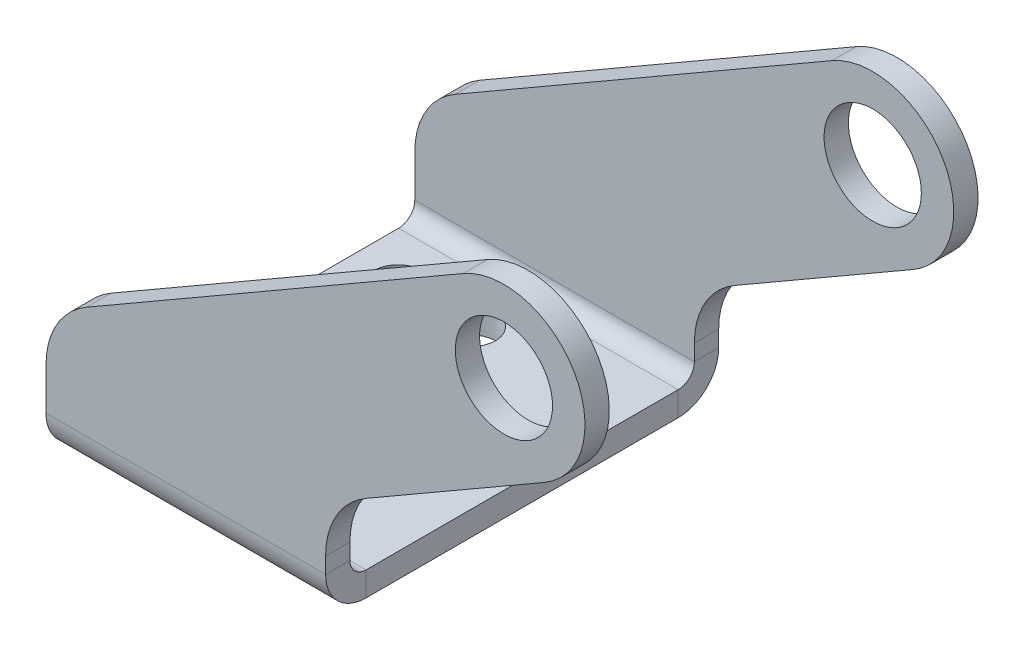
ISO-10303-21;
HEADER;
FILE_DESCRIPTION(('STEP AP214'),'2;1');
FILE_NAME('part.step','',(''),(''),'','','');
FILE_SCHEMA(('AUTOMOTIVE_DESIGN { 1 0 10303 214 1 1 1 1 }'));
ENDSEC;
DATA;
#1=APPLICATION_CONTEXT('core data for automotive mechanical design processes');
#2=APPLICATION_PROTOCOL_DEFINITION('international standard','automotive_design',2000,#1);
#3=PRODUCT_CONTEXT('',#1,'mechanical');
#4=PRODUCT('Part','Part','',(#3));
#5=PRODUCT_RELATED_PRODUCT_CATEGORY('part','',(#4));
#6=PRODUCT_DEFINITION_FORMATION('','',#4);
#7=PRODUCT_DEFINITION_CONTEXT('part definition',#1,'design');
#8=PRODUCT_DEFINITION('design','',#6,#7);
#9=PRODUCT_DEFINITION_SHAPE('','',#8);
#10=(LENGTH_UNIT() NAMED_UNIT(*) SI_UNIT(.MILLI.,.METRE.));
#11=(NAMED_UNIT(*) PLANE_ANGLE_UNIT() SI_UNIT($,.RADIAN.));
#12=(NAMED_UNIT(*) SI_UNIT($,.STERADIAN.) SOLID_ANGLE_UNIT());
#13=UNCERTAINTY_MEASURE_WITH_UNIT(LENGTH_MEASURE(1.E-05),#10,'distance_accuracy_value','');
#14=(GEOMETRIC_REPRESENTATION_CONTEXT(3) GLOBAL_UNCERTAINTY_ASSIGNED_CONTEXT((#13)) GLOBAL_UNIT_ASSIGNED_CONTEXT((#10,
#11,#12)) REPRESENTATION_CONTEXT('',''));
#15=CARTESIAN_POINT('',(0.,0.,0.));
#16=DIRECTION('',(0.,0.,1.));
#17=DIRECTION('',(1.,0.,0.));
#18=AXIS2_PLACEMENT_3D('',#15,#16,#17);
#19=CARTESIAN_POINT('',(10.,10.1532124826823,0.));
#20=DIRECTION('',(0.,0.,-1.));
#21=DIRECTION('',(-1.,0.,0.));
#22=AXIS2_PLACEMENT_3D('',#19,#20,#21);
#23=PLANE('',#22);
#24=DIRECTION('',(1.,0.,0.));
#25=VECTOR('',#24,1.);
#26=CARTESIAN_POINT('',(34.5,4.99999999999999,0.));
#27=LINE('',#26,#25);
#28=CARTESIAN_POINT('',(0.,4.99999999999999,0.));
#29=VERTEX_POINT('',#28);
#30=CARTESIAN_POINT('',(34.5,4.99999999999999,0.));
#31=VERTEX_POINT('',#30);
#32=EDGE_CURVE('E345',#29,#31,#27,.T.);
#33=ORIENTED_EDGE('',*,*,#32,.F.);
#34=DIRECTION('',(0.,-1.,0.));
#35=VECTOR('',#34,1.);
#36=CARTESIAN_POINT('',(0.,0.,0.));
#37=LINE('',#36,#35);
#38=CARTESIAN_POINT('',(0.,10.1532124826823,0.));
#39=VERTEX_POINT('',#38);
#40=EDGE_CURVE('E329',#39,#29,#37,.T.);
#41=ORIENTED_EDGE('',*,*,#40,.F.);
#42=CARTESIAN_POINT('',(10.,10.1532124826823,0.));
#43=DIRECTION('',(0.,0.,1.));
#44=DIRECTION('',(-1.,0.,0.));
#45=AXIS2_PLACEMENT_3D('',#42,#43,#44);
#46=CIRCLE('',#45,10.);
#47=CARTESIAN_POINT('',(4.99999999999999,18.8134665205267,0.));
#48=VERTEX_POINT('',#47);
#49=EDGE_CURVE('E332',#48,#39,#46,.T.);
#50=ORIENTED_EDGE('',*,*,#49,.F.);
#51=DIRECTION('',(-0.866025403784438,-0.500000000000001,0.));
#52=VECTOR('',#51,1.);
#53=CARTESIAN_POINT('',(4.99999999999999,18.8134665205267,0.));
#54=LINE('',#53,#52);
#55=CARTESIAN_POINT('',(51.5,45.6602540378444,0.));
#56=VERTEX_POINT('',#55);
#57=EDGE_CURVE('E335',#56,#48,#54,.T.);
#58=ORIENTED_EDGE('',*,*,#57,.F.);
#59=CARTESIAN_POINT('',(56.5,37.,0.));
#60=DIRECTION('',(0.,0.,1.));
#61=DIRECTION('',(-1.,0.,0.));
#62=AXIS2_PLACEMENT_3D('',#59,#60,#61);
#63=CIRCLE('',#62,10.);
#64=CARTESIAN_POINT('',(61.5,28.3397459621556,0.));
#65=VERTEX_POINT('',#64);
#66=EDGE_CURVE('E337',#65,#56,#63,.T.);
#67=ORIENTED_EDGE('',*,*,#66,.F.);
#68=DIRECTION('',(0.866025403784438,0.500000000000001,0.));
#69=VECTOR('',#68,1.);
#70=CARTESIAN_POINT('',(39.5,15.6380400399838,0.));
#71=LINE('',#70,#69);
#72=CARTESIAN_POINT('',(39.5,15.6380400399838,0.));
#73=VERTEX_POINT('',#72);
#74=EDGE_CURVE('E339',#73,#65,#71,.T.);
#75=ORIENTED_EDGE('',*,*,#74,.F.);
#76=CARTESIAN_POINT('',(44.5,6.97778600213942,0.));
#77=DIRECTION('',(0.,0.,-1.));
#78=DIRECTION('',(-1.,0.,0.));
#79=AXIS2_PLACEMENT_3D('',#76,#77,#78);
#80=CIRCLE('',#79,10.);
#81=CARTESIAN_POINT('',(34.5,6.97778600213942,0.));
#82=VERTEX_POINT('',#81);
#83=EDGE_CURVE('E47',#82,#73,#80,.T.);
#84=ORIENTED_EDGE('',*,*,#83,.F.);
#85=DIRECTION('',(0.,1.,0.));
#86=VECTOR('',#85,1.);
#87=CARTESIAN_POINT('',(34.5,0.,0.));
#88=LINE('',#87,#86);
#89=EDGE_CURVE('E40',#31,#82,#88,.T.);
#90=ORIENTED_EDGE('',*,*,#89,.F.);
#91=EDGE_LOOP('',(#33,#41,#50,#58,#67,#75,#84,#90));
#92=FACE_BOUND('',#91,.T.);
#93=CARTESIAN_POINT('',(56.5,37.,0.));
#94=DIRECTION('',(0.,0.,1.));
#95=DIRECTION('',(1.,0.,0.));
#96=AXIS2_PLACEMENT_3D('',#93,#94,#95);
#97=CIRCLE('',#96,5.99999999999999);
#98=CARTESIAN_POINT('',(62.5,37.,0.));
#99=VERTEX_POINT('',#98);
#100=EDGE_CURVE('E326',#99,#99,#97,.T.);
#101=ORIENTED_EDGE('',*,*,#100,.T.);
#102=EDGE_LOOP('',(#101));
#103=FACE_BOUND('',#102,.T.);
#104=ADVANCED_FACE('F26',(#92,#103),#23,.T.);
#105=CARTESIAN_POINT('',(56.5,37.,0.));
#106=DIRECTION('',(0.,0.,1.));
#107=DIRECTION('',(1.,0.,0.));
#108=AXIS2_PLACEMENT_3D('',#105,#106,#107);
#109=CYLINDRICAL_SURFACE('',#108,5.99999999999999);
#110=CARTESIAN_POINT('',(56.5,37.,3.));
#111=DIRECTION('',(0.,0.,-1.));
#112=DIRECTION('',(0.,1.,0.));
#113=AXIS2_PLACEMENT_3D('',#110,#111,#112);
#114=CIRCLE('',#113,5.99999999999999);
#115=CARTESIAN_POINT('',(62.5,37.,3.));
#116=VERTEX_POINT('',#115);
#117=EDGE_CURVE('E302',#116,#116,#114,.T.);
#118=CARTESIAN_POINT('',(62.5,37.,0.));
#119=CARTESIAN_POINT('',(62.5,37.,0.0312500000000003));
#120=CARTESIAN_POINT('',(62.5,37.,0.0625000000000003));
#121=CARTESIAN_POINT('',(62.5,37.,0.125));
#122=CARTESIAN_POINT('',(62.5,37.,0.15625));
#123=CARTESIAN_POINT('',(62.5,37.,0.218750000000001));
#124=CARTESIAN_POINT('',(62.5,37.,0.250000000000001));
#125=CARTESIAN_POINT('',(62.5,37.,0.312500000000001));
#126=CARTESIAN_POINT('',(62.5,37.,0.343750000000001));
#127=CARTESIAN_POINT('',(62.5,37.,0.406250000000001));
#128=CARTESIAN_POINT('',(62.5,37.,0.437500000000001));
#129=CARTESIAN_POINT('',(62.5,37.,0.500000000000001));
#130=CARTESIAN_POINT('',(62.5,37.,0.531250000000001));
#131=CARTESIAN_POINT('',(62.5,37.,0.593750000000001));
#132=CARTESIAN_POINT('',(62.5,37.,0.625000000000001));
#133=CARTESIAN_POINT('',(62.5,37.,0.687500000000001));
#134=CARTESIAN_POINT('',(62.5,37.,0.718750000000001));
#135=CARTESIAN_POINT('',(62.5,37.,0.781250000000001));
#136=CARTESIAN_POINT('',(62.5,37.,0.812500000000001));
#137=CARTESIAN_POINT('',(62.5,37.,0.875000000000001));
#138=CARTESIAN_POINT('',(62.5,37.,0.906250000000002));
#139=CARTESIAN_POINT('',(62.5,37.,0.968750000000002));
#140=CARTESIAN_POINT('',(62.5,37.,1.));
#141=CARTESIAN_POINT('',(62.5,37.,1.0625));
#142=CARTESIAN_POINT('',(62.5,37.,1.09375));
#143=CARTESIAN_POINT('',(62.5,37.,1.15625));
#144=CARTESIAN_POINT('',(62.5,37.,1.1875));
#145=CARTESIAN_POINT('',(62.5,37.,1.25));
#146=CARTESIAN_POINT('',(62.5,37.,1.28125));
#147=CARTESIAN_POINT('',(62.5,37.,1.34375));
#148=CARTESIAN_POINT('',(62.5,37.,1.375));
#149=CARTESIAN_POINT('',(62.5,37.,1.4375));
#150=CARTESIAN_POINT('',(62.5,37.,1.46875));
#151=CARTESIAN_POINT('',(62.5,37.,1.53125));
#152=CARTESIAN_POINT('',(62.5,37.,1.5625));
#153=CARTESIAN_POINT('',(62.5,37.,1.625));
#154=CARTESIAN_POINT('',(62.5,37.,1.65625));
#155=CARTESIAN_POINT('',(62.5,37.,1.71875));
#156=CARTESIAN_POINT('',(62.5,37.,1.75));
#157=CARTESIAN_POINT('',(62.5,37.,1.8125));
#158=CARTESIAN_POINT('',(62.5,37.,1.84375));
#159=CARTESIAN_POINT('',(62.5,37.,1.90625));
#160=CARTESIAN_POINT('',(62.5,37.,1.9375));
#161=CARTESIAN_POINT('',(62.5,37.,2.));
#162=CARTESIAN_POINT('',(62.5,37.,2.03125));
#163=CARTESIAN_POINT('',(62.5,37.,2.09375));
#164=CARTESIAN_POINT('',(62.5,37.,2.125));
#165=CARTESIAN_POINT('',(62.5,37.,2.1875));
#166=CARTESIAN_POINT('',(62.5,37.,2.21875));
#167=CARTESIAN_POINT('',(62.5,37.,2.28125));
#168=CARTESIAN_POINT('',(62.5,37.,2.3125));
#169=CARTESIAN_POINT('',(62.5,37.,2.375));
#170=CARTESIAN_POINT('',(62.5,37.,2.40625));
#171=CARTESIAN_POINT('',(62.5,37.,2.46875));
#172=CARTESIAN_POINT('',(62.5,37.,2.5));
#173=CARTESIAN_POINT('',(62.5,37.,2.5625));
#174=CARTESIAN_POINT('',(62.5,37.,2.59375));
#175=CARTESIAN_POINT('',(62.5,37.,2.65625));
#176=CARTESIAN_POINT('',(62.5,37.,2.6875));
#177=CARTESIAN_POINT('',(62.5,37.,2.75));
#178=CARTESIAN_POINT('',(62.5,37.,2.78125));
#179=CARTESIAN_POINT('',(62.5,37.,2.84375));
#180=CARTESIAN_POINT('',(62.5,37.,2.875));
#181=CARTESIAN_POINT('',(62.5,37.,2.9375));
#182=CARTESIAN_POINT('',(62.5,37.,2.96875));
#183=CARTESIAN_POINT('',(62.5,37.,3.));
#184=B_SPLINE_CURVE_WITH_KNOTS('',3,(#118,#119,#120,#121,#122,#123,#124,#125,#126,#127,#128,
#129,#130,#131,#132,#133,#134,#135,#136,#137,#138,#139,#140,#141,#142,#143,#144,#145,#146,#147,
#148,#149,#150,#151,#152,#153,#154,#155,#156,#157,#158,#159,#160,#161,#162,#163,#164,#165,#166,
#167,#168,#169,#170,#171,#172,#173,#174,#175,#176,#177,#178,#179,#180,#181,#182,#183),
.UNSPECIFIED.,.F.,.F.,(4,2,2,2,2,2,2,2,2,2,2,2,2,2,2,2,2,2,2,2,2,2,2,2,2,2,2,2,2,2,2,2,4),(0.,
0.0937500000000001,0.1875,0.28125,0.375,0.468750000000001,0.562500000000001,0.656250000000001,
0.750000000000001,0.843750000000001,0.937500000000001,1.03125,1.125,1.21875,1.3125,1.40625,1.5,
1.59375,1.6875,1.78125,1.875,1.96875,2.0625,2.15625,2.25,2.34375,2.4375,2.53125,2.625,2.71875,
2.8125,2.90625,3.),.UNSPECIFIED.);
#185=EDGE_CURVE('BSEAM394',#99,#116,#184,.T.);
#186=ORIENTED_EDGE('',*,*,#100,.F.);
#187=ORIENTED_EDGE('',*,*,#117,.F.);
#188=ORIENTED_EDGE('',*,*,#185,.T.);
#189=ORIENTED_EDGE('',*,*,#185,.F.);
#190=EDGE_LOOP('',(#186,#188,#187,#189));
#191=FACE_BOUND('',#190,.T.);
#192=ADVANCED_FACE('F394',(#191),#109,.F.);
#193=CARTESIAN_POINT('',(66.5,47.,3.));
#194=DIRECTION('',(0.,0.,-1.));
#195=DIRECTION('',(0.,1.,0.));
#196=AXIS2_PLACEMENT_3D('',#193,#194,#195);
#197=PLANE('',#196);
#198=ORIENTED_EDGE('',*,*,#117,.T.);
#199=EDGE_LOOP('',(#198));
#200=FACE_BOUND('',#199,.T.);
#201=DIRECTION('',(0.,-1.,0.));
#202=VECTOR('',#201,1.);
#203=CARTESIAN_POINT('',(0.,47.,3.));
#204=LINE('',#203,#202);
#205=CARTESIAN_POINT('',(0.,10.1532124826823,3.));
#206=VERTEX_POINT('',#205);
#207=CARTESIAN_POINT('',(0.,4.99999999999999,3.00000000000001));
#208=VERTEX_POINT('',#207);
#209=EDGE_CURVE('E320',#206,#208,#204,.T.);
#210=ORIENTED_EDGE('',*,*,#209,.T.);
#211=DIRECTION('',(1.,0.,0.));
#212=VECTOR('',#211,1.);
#213=CARTESIAN_POINT('',(34.5,4.99999999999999,3.));
#214=LINE('',#213,#212);
#215=CARTESIAN_POINT('',(34.5,4.99999999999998,3.00000000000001));
#216=VERTEX_POINT('',#215);
#217=EDGE_CURVE('E343',#208,#216,#214,.T.);
#218=ORIENTED_EDGE('',*,*,#217,.T.);
#219=DIRECTION('',(0.,-1.,0.));
#220=VECTOR('',#219,1.);
#221=CARTESIAN_POINT('',(34.5,0.,3.00000000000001));
#222=LINE('',#221,#220);
#223=CARTESIAN_POINT('',(34.5,6.97778600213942,3.00000000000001));
#224=VERTEX_POINT('',#223);
#225=EDGE_CURVE('E323',#224,#216,#222,.T.);
#226=ORIENTED_EDGE('',*,*,#225,.F.);
#227=CARTESIAN_POINT('',(44.5,6.97778600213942,3.00000000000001));
#228=DIRECTION('',(0.,0.,-1.));
#229=DIRECTION('',(0.,1.,0.));
#230=AXIS2_PLACEMENT_3D('',#227,#228,#229);
#231=CIRCLE('',#230,10.);
#232=CARTESIAN_POINT('',(39.5,15.6380400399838,3.00000000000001));
#233=VERTEX_POINT('',#232);
#234=EDGE_CURVE('E305',#233,#224,#231,.F.);
#235=ORIENTED_EDGE('',*,*,#234,.F.);
#236=DIRECTION('',(-0.866025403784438,-0.500000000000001,0.));
#237=VECTOR('',#236,1.);
#238=CARTESIAN_POINT('',(39.5,15.6380400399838,3.00000000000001));
#239=LINE('',#238,#237);
#240=CARTESIAN_POINT('',(61.5,28.3397459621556,3.));
#241=VERTEX_POINT('',#240);
#242=EDGE_CURVE('E308',#241,#233,#239,.T.);
#243=ORIENTED_EDGE('',*,*,#242,.F.);
#244=CARTESIAN_POINT('',(56.5,37.,3.));
#245=DIRECTION('',(0.,0.,-1.));
#246=DIRECTION('',(0.,1.,0.));
#247=AXIS2_PLACEMENT_3D('',#244,#245,#246);
#248=CIRCLE('',#247,10.);
#249=CARTESIAN_POINT('',(51.5,45.6602540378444,3.00000000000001));
#250=VERTEX_POINT('',#249);
#251=EDGE_CURVE('E311',#250,#241,#248,.T.);
#252=ORIENTED_EDGE('',*,*,#251,.F.);
#253=DIRECTION('',(0.866025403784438,0.500000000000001,0.));
#254=VECTOR('',#253,1.);
#255=CARTESIAN_POINT('',(4.99999999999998,18.8134665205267,3.00000000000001));
#256=LINE('',#255,#254);
#257=CARTESIAN_POINT('',(4.99999999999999,18.8134665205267,3.00000000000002));
#258=VERTEX_POINT('',#257);
#259=EDGE_CURVE('E314',#258,#250,#256,.T.);
#260=ORIENTED_EDGE('',*,*,#259,.F.);
#261=CARTESIAN_POINT('',(10.,10.1532124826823,3.00000000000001));
#262=DIRECTION('',(0.,0.,-1.));
#263=DIRECTION('',(0.,1.,0.));
#264=AXIS2_PLACEMENT_3D('',#261,#262,#263);
#265=CIRCLE('',#264,10.);
#266=EDGE_CURVE('E317',#206,#258,#265,.T.);
#267=ORIENTED_EDGE('',*,*,#266,.F.);
#268=EDGE_LOOP('',(#210,#218,#226,#235,#243,#252,#260,#267));
#269=FACE_BOUND('',#268,.T.);
#270=ADVANCED_FACE('F376',(#200,#269),#197,.F.);
#271=CARTESIAN_POINT('',(34.5,0.,160.30543537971));
#272=DIRECTION('',(1.,0.,0.));
#273=DIRECTION('',(0.,1.,0.));
#274=AXIS2_PLACEMENT_3D('',#271,#272,#273);
#275=PLANE('',#274);
#276=DIRECTION('',(0.,0.,-1.));
#277=VECTOR('',#276,1.);
#278=CARTESIAN_POINT('',(34.5,5.00000000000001,160.30543537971));
#279=LINE('',#278,#277);
#280=EDGE_CURVE('E11',#216,#31,#279,.T.);
#281=ORIENTED_EDGE('',*,*,#280,.T.);
#282=ORIENTED_EDGE('',*,*,#89,.T.);
#283=DIRECTION('',(0.,0.,-1.));
#284=VECTOR('',#283,1.);
#285=CARTESIAN_POINT('',(34.5,6.97778600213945,160.30543537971));
#286=LINE('',#285,#284);
#287=EDGE_CURVE('E34',#224,#82,#286,.T.);
#288=ORIENTED_EDGE('',*,*,#287,.F.);
#289=ORIENTED_EDGE('',*,*,#225,.T.);
#290=EDGE_LOOP('',(#281,#282,#288,#289));
#291=FACE_BOUND('',#290,.T.);
#292=ADVANCED_FACE('F28',(#291),#275,.T.);
#293=CARTESIAN_POINT('',(44.5,6.97778600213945,160.30543537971));
#294=DIRECTION('',(0.,0.,-1.));
#295=DIRECTION('',(0.,1.,0.));
#296=AXIS2_PLACEMENT_3D('',#293,#294,#295);
#297=CYLINDRICAL_SURFACE('',#296,10.);
#298=ORIENTED_EDGE('',*,*,#287,.T.);
#299=ORIENTED_EDGE('',*,*,#83,.T.);
#300=DIRECTION('',(0.,0.,-1.));
#301=VECTOR('',#300,1.);
#302=CARTESIAN_POINT('',(39.5,15.6380400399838,160.30543537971));
#303=LINE('',#302,#301);
#304=EDGE_CURVE('E361',#233,#73,#303,.T.);
#305=ORIENTED_EDGE('',*,*,#304,.F.);
#306=ORIENTED_EDGE('',*,*,#234,.T.);
#307=EDGE_LOOP('',(#298,#299,#305,#306));
#308=FACE_BOUND('',#307,.T.);
#309=ADVANCED_FACE('F362',(#308),#297,.F.);
#310=CARTESIAN_POINT('',(39.5,15.6380400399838,160.30543537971));
#311=DIRECTION('',(0.500000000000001,-0.866025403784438,0.));
#312=DIRECTION('',(0.866025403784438,0.500000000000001,0.));
#313=AXIS2_PLACEMENT_3D('',#310,#311,#312);
#314=PLANE('',#313);
#315=ORIENTED_EDGE('',*,*,#304,.T.);
#316=ORIENTED_EDGE('',*,*,#74,.T.);
#317=DIRECTION('',(0.,0.,-1.));
#318=VECTOR('',#317,1.);
#319=CARTESIAN_POINT('',(61.5,28.3397459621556,160.30543537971));
#320=LINE('',#319,#318);
#321=EDGE_CURVE('E358',#241,#65,#320,.T.);
#322=ORIENTED_EDGE('',*,*,#321,.F.);
#323=ORIENTED_EDGE('',*,*,#242,.T.);
#324=EDGE_LOOP('',(#315,#316,#322,#323));
#325=FACE_BOUND('',#324,.T.);
#326=ADVANCED_FACE('F371',(#325),#314,.T.);
#327=CARTESIAN_POINT('',(56.5,37.,160.30543537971));
#328=DIRECTION('',(0.,0.,-1.));
#329=DIRECTION('',(0.,1.,0.));
#330=AXIS2_PLACEMENT_3D('',#327,#328,#329);
#331=CYLINDRICAL_SURFACE('',#330,10.);
#332=ORIENTED_EDGE('',*,*,#321,.T.);
#333=ORIENTED_EDGE('',*,*,#66,.T.);
#334=DIRECTION('',(0.,0.,-1.));
#335=VECTOR('',#334,1.);
#336=CARTESIAN_POINT('',(51.5,45.6602540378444,160.30543537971));
#337=LINE('',#336,#335);
#338=EDGE_CURVE('E355',#250,#56,#337,.T.);
#339=ORIENTED_EDGE('',*,*,#338,.F.);
#340=ORIENTED_EDGE('',*,*,#251,.T.);
#341=EDGE_LOOP('',(#332,#333,#339,#340));
#342=FACE_BOUND('',#341,.T.);
#343=ADVANCED_FACE('F373',(#342),#331,.T.);
#344=CARTESIAN_POINT('',(4.99999999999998,18.8134665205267,160.30543537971));
#345=DIRECTION('',(-0.500000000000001,0.866025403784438,0.));
#346=DIRECTION('',(-0.866025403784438,-0.500000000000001,0.));
#347=AXIS2_PLACEMENT_3D('',#344,#345,#346);
#348=PLANE('',#347);
#349=ORIENTED_EDGE('',*,*,#338,.T.);
#350=ORIENTED_EDGE('',*,*,#57,.T.);
#351=DIRECTION('',(0.,0.,-1.));
#352=VECTOR('',#351,1.);
#353=CARTESIAN_POINT('',(4.99999999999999,18.8134665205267,160.30543537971));
#354=LINE('',#353,#352);
#355=EDGE_CURVE('E352',#258,#48,#354,.T.);
#356=ORIENTED_EDGE('',*,*,#355,.F.);
#357=ORIENTED_EDGE('',*,*,#259,.T.);
#358=EDGE_LOOP('',(#349,#350,#356,#357));
#359=FACE_BOUND('',#358,.T.);
#360=ADVANCED_FACE('F379',(#359),#348,.T.);
#361=CARTESIAN_POINT('',(10.,10.1532124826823,160.30543537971));
#362=DIRECTION('',(0.,0.,-1.));
#363=DIRECTION('',(0.,1.,0.));
#364=AXIS2_PLACEMENT_3D('',#361,#362,#363);
#365=CYLINDRICAL_SURFACE('',#364,10.);
#366=ORIENTED_EDGE('',*,*,#355,.T.);
#367=ORIENTED_EDGE('',*,*,#49,.T.);
#368=DIRECTION('',(0.,0.,-1.));
#369=VECTOR('',#368,1.);
#370=CARTESIAN_POINT('',(0.,10.1532124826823,160.30543537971));
#371=LINE('',#370,#369);
#372=EDGE_CURVE('E350',#206,#39,#371,.T.);
#373=ORIENTED_EDGE('',*,*,#372,.F.);
#374=ORIENTED_EDGE('',*,*,#266,.T.);
#375=EDGE_LOOP('',(#366,#367,#373,#374));
#376=FACE_BOUND('',#375,.T.);
#377=ADVANCED_FACE('F382',(#376),#365,.T.);
#378=CARTESIAN_POINT('',(0.,47.,160.30543537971));
#379=DIRECTION('',(1.,0.,0.));
#380=DIRECTION('',(0.,1.,0.));
#381=AXIS2_PLACEMENT_3D('',#378,#379,#380);
#382=PLANE('',#381);
#383=ORIENTED_EDGE('',*,*,#40,.T.);
#384=DIRECTION('',(0.,0.,-1.));
#385=VECTOR('',#384,1.);
#386=CARTESIAN_POINT('',(0.,5.00000000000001,160.30543537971));
#387=LINE('',#386,#385);
#388=EDGE_CURVE('E348',#208,#29,#387,.T.);
#389=ORIENTED_EDGE('',*,*,#388,.F.);
#390=ORIENTED_EDGE('',*,*,#209,.F.);
#391=ORIENTED_EDGE('',*,*,#372,.T.);
#392=EDGE_LOOP('',(#383,#389,#390,#391));
#393=FACE_BOUND('',#392,.T.);
#394=ADVANCED_FACE('F387',(#393),#382,.F.);
#395=CARTESIAN_POINT('',(10.,10.1532124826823,48.5));
#396=DIRECTION('',(0.,0.,-1.));
#397=DIRECTION('',(-1.,0.,0.));
#398=AXIS2_PLACEMENT_3D('',#395,#396,#397);
#399=PLANE('',#398);
#400=CARTESIAN_POINT('',(56.5,37.,48.5));
#401=DIRECTION('',(0.,0.,1.));
#402=DIRECTION('',(1.,0.,0.));
#403=AXIS2_PLACEMENT_3D('',#400,#401,#402);
#404=CIRCLE('',#403,5.99999999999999);
#405=CARTESIAN_POINT('',(62.5,37.,48.5));
#406=VERTEX_POINT('',#405);
#407=EDGE_CURVE('E247',#406,#406,#404,.T.);
#408=ORIENTED_EDGE('',*,*,#407,.F.);
#409=EDGE_LOOP('',(#408));
#410=FACE_BOUND('',#409,.T.);
#411=DIRECTION('',(0.,-1.,0.));
#412=VECTOR('',#411,1.);
#413=CARTESIAN_POINT('',(0.,0.,48.5));
#414=LINE('',#413,#412);
#415=CARTESIAN_POINT('',(0.,10.1532124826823,48.5));
#416=VERTEX_POINT('',#415);
#417=CARTESIAN_POINT('',(0.,4.99999999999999,48.5));
#418=VERTEX_POINT('',#417);
#419=EDGE_CURVE('E250',#416,#418,#414,.T.);
#420=ORIENTED_EDGE('',*,*,#419,.T.);
#421=DIRECTION('',(1.,0.,0.));
#422=VECTOR('',#421,1.);
#423=CARTESIAN_POINT('',(0.,4.99999999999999,48.5));
#424=LINE('',#423,#422);
#425=CARTESIAN_POINT('',(34.5,4.99999999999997,48.5));
#426=VERTEX_POINT('',#425);
#427=EDGE_CURVE('E271',#418,#426,#424,.T.);
#428=ORIENTED_EDGE('',*,*,#427,.T.);
#429=DIRECTION('',(0.,1.,0.));
#430=VECTOR('',#429,1.);
#431=CARTESIAN_POINT('',(34.5,0.,48.5));
#432=LINE('',#431,#430);
#433=CARTESIAN_POINT('',(34.5,6.97778600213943,48.5));
#434=VERTEX_POINT('',#433);
#435=EDGE_CURVE('E299',#426,#434,#432,.T.);
#436=ORIENTED_EDGE('',*,*,#435,.T.);
#437=CARTESIAN_POINT('',(44.5,6.97778600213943,48.5));
#438=DIRECTION('',(0.,0.,-1.));
#439=DIRECTION('',(-1.,0.,0.));
#440=AXIS2_PLACEMENT_3D('',#437,#438,#439);
#441=CIRCLE('',#440,10.);
#442=CARTESIAN_POINT('',(39.5,15.6380400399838,48.5));
#443=VERTEX_POINT('',#442);
#444=EDGE_CURVE('E253',#434,#443,#441,.T.);
#445=ORIENTED_EDGE('',*,*,#444,.T.);
#446=DIRECTION('',(0.866025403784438,0.500000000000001,0.));
#447=VECTOR('',#446,1.);
#448=CARTESIAN_POINT('',(39.5,15.6380400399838,48.5));
#449=LINE('',#448,#447);
#450=CARTESIAN_POINT('',(61.5,28.3397459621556,48.5));
#451=VERTEX_POINT('',#450);
#452=EDGE_CURVE('E256',#443,#451,#449,.T.);
#453=ORIENTED_EDGE('',*,*,#452,.T.);
#454=CARTESIAN_POINT('',(56.5,37.,48.5));
#455=DIRECTION('',(0.,0.,1.));
#456=DIRECTION('',(-1.,0.,0.));
#457=AXIS2_PLACEMENT_3D('',#454,#455,#456);
#458=CIRCLE('',#457,10.);
#459=CARTESIAN_POINT('',(51.5,45.6602540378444,48.5));
#460=VERTEX_POINT('',#459);
#461=EDGE_CURVE('E259',#451,#460,#458,.T.);
#462=ORIENTED_EDGE('',*,*,#461,.T.);
#463=DIRECTION('',(-0.866025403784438,-0.500000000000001,0.));
#464=VECTOR('',#463,1.);
#465=CARTESIAN_POINT('',(4.99999999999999,18.8134665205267,48.5));
#466=LINE('',#465,#464);
#467=CARTESIAN_POINT('',(4.99999999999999,18.8134665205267,48.5));
#468=VERTEX_POINT('',#467);
#469=EDGE_CURVE('E262',#460,#468,#466,.T.);
#470=ORIENTED_EDGE('',*,*,#469,.T.);
#471=CARTESIAN_POINT('',(10.,10.1532124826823,48.5));
#472=DIRECTION('',(0.,0.,1.));
#473=DIRECTION('',(-1.,0.,0.));
#474=AXIS2_PLACEMENT_3D('',#471,#472,#473);
#475=CIRCLE('',#474,10.);
#476=EDGE_CURVE('E265',#468,#416,#475,.T.);
#477=ORIENTED_EDGE('',*,*,#476,.T.);
#478=EDGE_LOOP('',(#420,#428,#436,#445,#453,#462,#470,#477));
#479=FACE_BOUND('',#478,.T.);
#480=ADVANCED_FACE('F407',(#410,#479),#399,.F.);
#481=CARTESIAN_POINT('',(56.5,37.,0.));
#482=DIRECTION('',(0.,0.,1.));
#483=DIRECTION('',(1.,0.,0.));
#484=AXIS2_PLACEMENT_3D('',#481,#482,#483);
#485=CYLINDRICAL_SURFACE('',#484,5.99999999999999);
#486=CARTESIAN_POINT('',(56.5,37.,45.5));
#487=DIRECTION('',(0.,0.,1.));
#488=DIRECTION('',(0.,-1.,0.));
#489=AXIS2_PLACEMENT_3D('',#486,#487,#488);
#490=CIRCLE('',#489,5.99999999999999);
#491=CARTESIAN_POINT('',(62.5,37.,45.5));
#492=VERTEX_POINT('',#491);
#493=EDGE_CURVE('E231',#492,#492,#490,.T.);
#494=CARTESIAN_POINT('',(62.5,37.,48.5));
#495=CARTESIAN_POINT('',(62.5,37.,48.46875));
#496=CARTESIAN_POINT('',(62.5,37.,48.4375));
#497=CARTESIAN_POINT('',(62.5,37.,48.375));
#498=CARTESIAN_POINT('',(62.5,37.,48.34375));
#499=CARTESIAN_POINT('',(62.5,37.,48.28125));
#500=CARTESIAN_POINT('',(62.5,37.,48.25));
#501=CARTESIAN_POINT('',(62.5,37.,48.1875));
#502=CARTESIAN_POINT('',(62.5,37.,48.15625));
#503=CARTESIAN_POINT('',(62.5,37.,48.09375));
#504=CARTESIAN_POINT('',(62.5,37.,48.0625));
#505=CARTESIAN_POINT('',(62.5,37.,48.));
#506=CARTESIAN_POINT('',(62.5,37.,47.96875));
#507=CARTESIAN_POINT('',(62.5,37.,47.90625));
#508=CARTESIAN_POINT('',(62.5,37.,47.875));
#509=CARTESIAN_POINT('',(62.5,37.,47.8125));
#510=CARTESIAN_POINT('',(62.5,37.,47.78125));
#511=CARTESIAN_POINT('',(62.5,37.,47.71875));
#512=CARTESIAN_POINT('',(62.5,37.,47.6875));
#513=CARTESIAN_POINT('',(62.5,37.,47.625));
#514=CARTESIAN_POINT('',(62.5,37.,47.59375));
#515=CARTESIAN_POINT('',(62.5,37.,47.53125));
#516=CARTESIAN_POINT('',(62.5,37.,47.5));
#517=CARTESIAN_POINT('',(62.5,37.,47.4375));
#518=CARTESIAN_POINT('',(62.5,37.,47.40625));
#519=CARTESIAN_POINT('',(62.5,37.,47.34375));
#520=CARTESIAN_POINT('',(62.5,37.,47.3125));
#521=CARTESIAN_POINT('',(62.5,37.,47.25));
#522=CARTESIAN_POINT('',(62.5,37.,47.21875));
#523=CARTESIAN_POINT('',(62.5,37.,47.15625));
#524=CARTESIAN_POINT('',(62.5,37.,47.125));
#525=CARTESIAN_POINT('',(62.5,37.,47.0625));
#526=CARTESIAN_POINT('',(62.5,37.,47.03125));
#527=CARTESIAN_POINT('',(62.5,37.,46.96875));
#528=CARTESIAN_POINT('',(62.5,37.,46.9375));
#529=CARTESIAN_POINT('',(62.5,37.,46.875));
#530=CARTESIAN_POINT('',(62.5,37.,46.84375));
#531=CARTESIAN_POINT('',(62.5,37.,46.78125));
#532=CARTESIAN_POINT('',(62.5,37.,46.75));
#533=CARTESIAN_POINT('',(62.5,37.,46.6875));
#534=CARTESIAN_POINT('',(62.5,37.,46.65625));
#535=CARTESIAN_POINT('',(62.5,37.,46.59375));
#536=CARTESIAN_POINT('',(62.5,37.,46.5625));
#537=CARTESIAN_POINT('',(62.5,37.,46.5));
#538=CARTESIAN_POINT('',(62.5,37.,46.46875));
#539=CARTESIAN_POINT('',(62.5,37.,46.40625));
#540=CARTESIAN_POINT('',(62.5,37.,46.375));
#541=CARTESIAN_POINT('',(62.5,37.,46.3125));
#542=CARTESIAN_POINT('',(62.5,37.,46.28125));
#543=CARTESIAN_POINT('',(62.5,37.,46.21875));
#544=CARTESIAN_POINT('',(62.5,37.,46.1875));
#545=CARTESIAN_POINT('',(62.5,37.,46.125));
#546=CARTESIAN_POINT('',(62.5,37.,46.09375));
#547=CARTESIAN_POINT('',(62.5,37.,46.03125));
#548=CARTESIAN_POINT('',(62.5,37.,46.));
#549=CARTESIAN_POINT('',(62.5,37.,45.9375));
#550=CARTESIAN_POINT('',(62.5,37.,45.90625));
#551=CARTESIAN_POINT('',(62.5,37.,45.84375));
#552=CARTESIAN_POINT('',(62.5,37.,45.8125));
#553=CARTESIAN_POINT('',(62.5,37.,45.75));
#554=CARTESIAN_POINT('',(62.5,37.,45.71875));
#555=CARTESIAN_POINT('',(62.5,37.,45.65625));
#556=CARTESIAN_POINT('',(62.5,37.,45.625));
#557=CARTESIAN_POINT('',(62.5,37.,45.5625));
#558=CARTESIAN_POINT('',(62.5,37.,45.53125));
#559=CARTESIAN_POINT('',(62.5,37.,45.5));
#560=B_SPLINE_CURVE_WITH_KNOTS('',3,(#494,#495,#496,#497,#498,#499,#500,#501,#502,#503,#504,
#505,#506,#507,#508,#509,#510,#511,#512,#513,#514,#515,#516,#517,#518,#519,#520,#521,#522,#523,
#524,#525,#526,#527,#528,#529,#530,#531,#532,#533,#534,#535,#536,#537,#538,#539,#540,#541,#542,
#543,#544,#545,#546,#547,#548,#549,#550,#551,#552,#553,#554,#555,#556,#557,#558,#559),
.UNSPECIFIED.,.F.,.F.,(4,2,2,2,2,2,2,2,2,2,2,2,2,2,2,2,2,2,2,2,2,2,2,2,2,2,2,2,2,2,2,2,4),(0.,
0.0937500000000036,0.1875,0.281249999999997,0.375,0.468750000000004,0.5625,0.656249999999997,
0.750000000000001,0.843750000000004,0.937500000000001,1.03125,1.125,1.21875,1.3125,1.40625,1.5,
1.59375,1.6875,1.78125,1.875,1.96875000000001,2.0625,2.15625,2.25,2.34375000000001,2.4375,
2.53125,2.625,2.71875000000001,2.8125,2.90625,3.),.UNSPECIFIED.);
#561=EDGE_CURVE('BSEAM443',#406,#492,#560,.T.);
#562=ORIENTED_EDGE('',*,*,#407,.T.);
#563=ORIENTED_EDGE('',*,*,#493,.F.);
#564=ORIENTED_EDGE('',*,*,#561,.T.);
#565=ORIENTED_EDGE('',*,*,#561,.F.);
#566=EDGE_LOOP('',(#562,#564,#563,#565));
#567=FACE_BOUND('',#566,.T.);
#568=ADVANCED_FACE('F443',(#567),#485,.F.);
#569=CARTESIAN_POINT('',(66.5,47.,45.5));
#570=DIRECTION('',(0.,0.,1.));
#571=DIRECTION('',(0.,-1.,0.));
#572=AXIS2_PLACEMENT_3D('',#569,#570,#571);
#573=PLANE('',#572);
#574=ORIENTED_EDGE('',*,*,#493,.T.);
#575=EDGE_LOOP('',(#574));
#576=FACE_BOUND('',#575,.T.);
#577=DIRECTION('',(0.,-1.,0.));
#578=VECTOR('',#577,1.);
#579=CARTESIAN_POINT('',(34.5,0.,45.5));
#580=LINE('',#579,#578);
#581=CARTESIAN_POINT('',(34.5,6.97778600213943,45.5));
#582=VERTEX_POINT('',#581);
#583=CARTESIAN_POINT('',(34.5,4.99999999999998,45.5));
#584=VERTEX_POINT('',#583);
#585=EDGE_CURVE('E296',#582,#584,#580,.T.);
#586=ORIENTED_EDGE('',*,*,#585,.T.);
#587=DIRECTION('',(-1.,0.,0.));
#588=VECTOR('',#587,1.);
#589=CARTESIAN_POINT('',(0.,4.99999999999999,45.5));
#590=LINE('',#589,#588);
#591=CARTESIAN_POINT('',(0.,4.99999999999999,45.5));
#592=VERTEX_POINT('',#591);
#593=EDGE_CURVE('E268',#584,#592,#590,.T.);
#594=ORIENTED_EDGE('',*,*,#593,.T.);
#595=DIRECTION('',(0.,1.,0.));
#596=VECTOR('',#595,1.);
#597=CARTESIAN_POINT('',(0.,47.,45.5));
#598=LINE('',#597,#596);
#599=CARTESIAN_POINT('',(0.,10.1532124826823,45.5));
#600=VERTEX_POINT('',#599);
#601=EDGE_CURVE('E234',#592,#600,#598,.T.);
#602=ORIENTED_EDGE('',*,*,#601,.T.);
#603=CARTESIAN_POINT('',(10.,10.1532124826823,45.5));
#604=DIRECTION('',(0.,0.,1.));
#605=DIRECTION('',(0.,-1.,0.));
#606=AXIS2_PLACEMENT_3D('',#603,#604,#605);
#607=CIRCLE('',#606,10.);
#608=CARTESIAN_POINT('',(4.99999999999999,18.8134665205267,45.5));
#609=VERTEX_POINT('',#608);
#610=EDGE_CURVE('E237',#609,#600,#607,.T.);
#611=ORIENTED_EDGE('',*,*,#610,.F.);
#612=DIRECTION('',(-0.866025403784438,-0.500000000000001,0.));
#613=VECTOR('',#612,1.);
#614=CARTESIAN_POINT('',(4.99999999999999,18.8134665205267,45.5));
#615=LINE('',#614,#613);
#616=CARTESIAN_POINT('',(51.5,45.6602540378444,45.5));
#617=VERTEX_POINT('',#616);
#618=EDGE_CURVE('E239',#617,#609,#615,.T.);
#619=ORIENTED_EDGE('',*,*,#618,.F.);
#620=CARTESIAN_POINT('',(56.5,37.,45.5));
#621=DIRECTION('',(0.,0.,1.));
#622=DIRECTION('',(0.,-1.,0.));
#623=AXIS2_PLACEMENT_3D('',#620,#621,#622);
#624=CIRCLE('',#623,10.);
#625=CARTESIAN_POINT('',(61.5,28.3397459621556,45.5));
#626=VERTEX_POINT('',#625);
#627=EDGE_CURVE('E241',#626,#617,#624,.T.);
#628=ORIENTED_EDGE('',*,*,#627,.F.);
#629=DIRECTION('',(0.866025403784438,0.500000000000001,0.));
#630=VECTOR('',#629,1.);
#631=CARTESIAN_POINT('',(39.5,15.6380400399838,45.5));
#632=LINE('',#631,#630);
#633=CARTESIAN_POINT('',(39.5,15.6380400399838,45.5));
#634=VERTEX_POINT('',#633);
#635=EDGE_CURVE('E243',#634,#626,#632,.T.);
#636=ORIENTED_EDGE('',*,*,#635,.F.);
#637=CARTESIAN_POINT('',(44.5,6.97778600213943,45.5));
#638=DIRECTION('',(0.,0.,1.));
#639=DIRECTION('',(0.,-1.,0.));
#640=AXIS2_PLACEMENT_3D('',#637,#638,#639);
#641=CIRCLE('',#640,10.);
#642=EDGE_CURVE('E245',#582,#634,#641,.F.);
#643=ORIENTED_EDGE('',*,*,#642,.F.);
#644=EDGE_LOOP('',(#586,#594,#602,#611,#619,#628,#636,#643));
#645=FACE_BOUND('',#644,.T.);
#646=ADVANCED_FACE('F408',(#576,#645),#573,.F.);
#647=CARTESIAN_POINT('',(0.,47.,-111.80543537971));
#648=DIRECTION('',(1.,0.,0.));
#649=DIRECTION('',(0.,-1.,0.));
#650=AXIS2_PLACEMENT_3D('',#647,#648,#649);
#651=PLANE('',#650);
#652=DIRECTION('',(0.,0.,1.));
#653=VECTOR('',#652,1.);
#654=CARTESIAN_POINT('',(0.,5.00000000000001,-111.80543537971));
#655=LINE('',#654,#653);
#656=EDGE_CURVE('E293',#592,#418,#655,.T.);
#657=ORIENTED_EDGE('',*,*,#656,.T.);
#658=ORIENTED_EDGE('',*,*,#419,.F.);
#659=DIRECTION('',(0.,0.,1.));
#660=VECTOR('',#659,1.);
#661=CARTESIAN_POINT('',(0.,10.1532124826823,-111.80543537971));
#662=LINE('',#661,#660);
#663=EDGE_CURVE('E290',#600,#416,#662,.T.);
#664=ORIENTED_EDGE('',*,*,#663,.F.);
#665=ORIENTED_EDGE('',*,*,#601,.F.);
#666=EDGE_LOOP('',(#657,#658,#664,#665));
#667=FACE_BOUND('',#666,.T.);
#668=ADVANCED_FACE('F446',(#667),#651,.F.);
#669=CARTESIAN_POINT('',(10.,10.1532124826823,-111.80543537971));
#670=DIRECTION('',(0.,0.,1.));
#671=DIRECTION('',(0.,-1.,0.));
#672=AXIS2_PLACEMENT_3D('',#669,#670,#671);
#673=CYLINDRICAL_SURFACE('',#672,10.);
#674=ORIENTED_EDGE('',*,*,#476,.F.);
#675=DIRECTION('',(0.,0.,1.));
#676=VECTOR('',#675,1.);
#677=CARTESIAN_POINT('',(4.99999999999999,18.8134665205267,-111.80543537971));
#678=LINE('',#677,#676);
#679=EDGE_CURVE('E287',#609,#468,#678,.T.);
#680=ORIENTED_EDGE('',*,*,#679,.F.);
#681=ORIENTED_EDGE('',*,*,#610,.T.);
#682=ORIENTED_EDGE('',*,*,#663,.T.);
#683=EDGE_LOOP('',(#674,#680,#681,#682));
#684=FACE_BOUND('',#683,.T.);
#685=ADVANCED_FACE('F466',(#684),#673,.T.);
#686=CARTESIAN_POINT('',(4.99999999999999,18.8134665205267,-111.80543537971));
#687=DIRECTION('',(-0.500000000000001,0.866025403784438,0.));
#688=DIRECTION('',(0.866025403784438,0.500000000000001,0.));
#689=AXIS2_PLACEMENT_3D('',#686,#687,#688);
#690=PLANE('',#689);
#691=ORIENTED_EDGE('',*,*,#469,.F.);
#692=DIRECTION('',(0.,0.,1.));
#693=VECTOR('',#692,1.);
#694=CARTESIAN_POINT('',(51.5,45.6602540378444,-111.80543537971));
#695=LINE('',#694,#693);
#696=EDGE_CURVE('E284',#617,#460,#695,.T.);
#697=ORIENTED_EDGE('',*,*,#696,.F.);
#698=ORIENTED_EDGE('',*,*,#618,.T.);
#699=ORIENTED_EDGE('',*,*,#679,.T.);
#700=EDGE_LOOP('',(#691,#697,#698,#699));
#701=FACE_BOUND('',#700,.T.);
#702=ADVANCED_FACE('F474',(#701),#690,.T.);
#703=CARTESIAN_POINT('',(56.5,37.,-111.80543537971));
#704=DIRECTION('',(0.,0.,1.));
#705=DIRECTION('',(0.,-1.,0.));
#706=AXIS2_PLACEMENT_3D('',#703,#704,#705);
#707=CYLINDRICAL_SURFACE('',#706,10.);
#708=ORIENTED_EDGE('',*,*,#461,.F.);
#709=DIRECTION('',(0.,0.,1.));
#710=VECTOR('',#709,1.);
#711=CARTESIAN_POINT('',(61.5,28.3397459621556,-111.80543537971));
#712=LINE('',#711,#710);
#713=EDGE_CURVE('E281',#626,#451,#712,.T.);
#714=ORIENTED_EDGE('',*,*,#713,.F.);
#715=ORIENTED_EDGE('',*,*,#627,.T.);
#716=ORIENTED_EDGE('',*,*,#696,.T.);
#717=EDGE_LOOP('',(#708,#714,#715,#716));
#718=FACE_BOUND('',#717,.T.);
#719=ADVANCED_FACE('F482',(#718),#707,.T.);
#720=CARTESIAN_POINT('',(39.5,15.6380400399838,-111.80543537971));
#721=DIRECTION('',(0.500000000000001,-0.866025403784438,0.));
#722=DIRECTION('',(-0.866025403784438,-0.500000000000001,0.));
#723=AXIS2_PLACEMENT_3D('',#720,#721,#722);
#724=PLANE('',#723);
#725=ORIENTED_EDGE('',*,*,#452,.F.);
#726=DIRECTION('',(0.,0.,1.));
#727=VECTOR('',#726,1.);
#728=CARTESIAN_POINT('',(39.5,15.6380400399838,-111.80543537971));
#729=LINE('',#728,#727);
#730=EDGE_CURVE('E278',#634,#443,#729,.T.);
#731=ORIENTED_EDGE('',*,*,#730,.F.);
#732=ORIENTED_EDGE('',*,*,#635,.T.);
#733=ORIENTED_EDGE('',*,*,#713,.T.);
#734=EDGE_LOOP('',(#725,#731,#732,#733));
#735=FACE_BOUND('',#734,.T.);
#736=ADVANCED_FACE('F490',(#735),#724,.T.);
#737=CARTESIAN_POINT('',(44.5,6.97778600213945,-111.80543537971));
#738=DIRECTION('',(0.,0.,1.));
#739=DIRECTION('',(0.,-1.,0.));
#740=AXIS2_PLACEMENT_3D('',#737,#738,#739);
#741=CYLINDRICAL_SURFACE('',#740,10.);
#742=ORIENTED_EDGE('',*,*,#444,.F.);
#743=DIRECTION('',(0.,0.,1.));
#744=VECTOR('',#743,1.);
#745=CARTESIAN_POINT('',(34.5,6.97778600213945,-111.80543537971));
#746=LINE('',#745,#744);
#747=EDGE_CURVE('E276',#582,#434,#746,.T.);
#748=ORIENTED_EDGE('',*,*,#747,.F.);
#749=ORIENTED_EDGE('',*,*,#642,.T.);
#750=ORIENTED_EDGE('',*,*,#730,.T.);
#751=EDGE_LOOP('',(#742,#748,#749,#750));
#752=FACE_BOUND('',#751,.T.);
#753=ADVANCED_FACE('F498',(#752),#741,.F.);
#754=CARTESIAN_POINT('',(34.5,0.,-111.80543537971));
#755=DIRECTION('',(1.,0.,0.));
#756=DIRECTION('',(0.,-1.,0.));
#757=AXIS2_PLACEMENT_3D('',#754,#755,#756);
#758=PLANE('',#757);
#759=ORIENTED_EDGE('',*,*,#435,.F.);
#760=DIRECTION('',(0.,0.,1.));
#761=VECTOR('',#760,1.);
#762=CARTESIAN_POINT('',(34.5,5.00000000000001,-111.80543537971));
#763=LINE('',#762,#761);
#764=EDGE_CURVE('E274',#584,#426,#763,.T.);
#765=ORIENTED_EDGE('',*,*,#764,.F.);
#766=ORIENTED_EDGE('',*,*,#585,.F.);
#767=ORIENTED_EDGE('',*,*,#747,.T.);
#768=EDGE_LOOP('',(#759,#765,#766,#767));
#769=FACE_BOUND('',#768,.T.);
#770=ADVANCED_FACE('F506',(#769),#758,.T.);
#771=CARTESIAN_POINT('',(0.,0.,48.5));
#772=DIRECTION('',(0.,1.,0.));
#773=DIRECTION('',(0.,0.,1.));
#774=AXIS2_PLACEMENT_3D('',#771,#772,#773);
#775=PLANE('',#774);
#776=CARTESIAN_POINT('',(15.,0.,11.05));
#777=DIRECTION('',(0.,1.,0.));
#778=DIRECTION('',(0.,0.,1.));
#779=AXIS2_PLACEMENT_3D('',#776,#777,#778);
#780=CIRCLE('',#779,3.);
#781=CARTESIAN_POINT('',(15.,0.,14.05));
#782=VERTEX_POINT('',#781);
#783=EDGE_CURVE('E200',#782,#782,#780,.T.);
#784=ORIENTED_EDGE('',*,*,#783,.T.);
#785=EDGE_LOOP('',(#784));
#786=FACE_BOUND('',#785,.T.);
#787=CARTESIAN_POINT('',(6.,0.,11.05));
#788=DIRECTION('',(0.,1.,0.));
#789=DIRECTION('',(0.,0.,-1.));
#790=AXIS2_PLACEMENT_3D('',#787,#788,#789);
#791=CIRCLE('',#790,3.);
#792=CARTESIAN_POINT('',(6.,0.,8.05));
#793=VERTEX_POINT('',#792);
#794=EDGE_CURVE('E204',#793,#793,#791,.T.);
#795=ORIENTED_EDGE('',*,*,#794,.T.);
#796=EDGE_LOOP('',(#795));
#797=FACE_BOUND('',#796,.T.);
#798=CARTESIAN_POINT('',(15.,0.,37.45));
#799=DIRECTION('',(0.,1.,0.));
#800=DIRECTION('',(0.,0.,-1.));
#801=AXIS2_PLACEMENT_3D('',#798,#799,#800);
#802=CIRCLE('',#801,3.);
#803=CARTESIAN_POINT('',(15.,0.,34.45));
#804=VERTEX_POINT('',#803);
#805=EDGE_CURVE('E212',#804,#804,#802,.T.);
#806=ORIENTED_EDGE('',*,*,#805,.T.);
#807=EDGE_LOOP('',(#806));
#808=FACE_BOUND('',#807,.T.);
#809=CARTESIAN_POINT('',(6.,0.,37.45));
#810=DIRECTION('',(0.,1.,0.));
#811=DIRECTION('',(0.,0.,1.));
#812=AXIS2_PLACEMENT_3D('',#809,#810,#811);
#813=CIRCLE('',#812,3.);
#814=CARTESIAN_POINT('',(6.,0.,40.45));
#815=VERTEX_POINT('',#814);
#816=EDGE_CURVE('E215',#815,#815,#813,.T.);
#817=ORIENTED_EDGE('',*,*,#816,.T.);
#818=EDGE_LOOP('',(#817));
#819=FACE_BOUND('',#818,.T.);
#820=DIRECTION('',(-1.,0.,0.));
#821=VECTOR('',#820,1.);
#822=CARTESIAN_POINT('',(34.5,0.,5.00000000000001));
#823=LINE('',#822,#821);
#824=CARTESIAN_POINT('',(34.5,0.,5.00000000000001));
#825=VERTEX_POINT('',#824);
#826=CARTESIAN_POINT('',(0.,0.,5.00000000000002));
#827=VERTEX_POINT('',#826);
#828=EDGE_CURVE('E183',#825,#827,#823,.T.);
#829=ORIENTED_EDGE('',*,*,#828,.F.);
#830=DIRECTION('',(0.,0.,-1.));
#831=VECTOR('',#830,1.);
#832=CARTESIAN_POINT('',(34.5,0.,48.5));
#833=LINE('',#832,#831);
#834=CARTESIAN_POINT('',(34.5,0.,43.5));
#835=VERTEX_POINT('',#834);
#836=EDGE_CURVE('E193',#835,#825,#833,.T.);
#837=ORIENTED_EDGE('',*,*,#836,.F.);
#838=DIRECTION('',(1.,0.,0.));
#839=VECTOR('',#838,1.);
#840=CARTESIAN_POINT('',(0.,0.,43.5));
#841=LINE('',#840,#839);
#842=CARTESIAN_POINT('',(0.,0.,43.5));
#843=VERTEX_POINT('',#842);
#844=EDGE_CURVE('E229',#843,#835,#841,.T.);
#845=ORIENTED_EDGE('',*,*,#844,.F.);
#846=DIRECTION('',(0.,0.,-1.));
#847=VECTOR('',#846,1.);
#848=CARTESIAN_POINT('',(0.,0.,48.5));
#849=LINE('',#848,#847);
#850=EDGE_CURVE('E184',#843,#827,#849,.T.);
#851=ORIENTED_EDGE('',*,*,#850,.T.);
#852=EDGE_LOOP('',(#829,#837,#845,#851));
#853=FACE_BOUND('',#852,.T.);
#854=ADVANCED_FACE('F514',(#786,#797,#808,#819,#853),#775,.F.);
#855=CARTESIAN_POINT('',(66.5,2.99999999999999,3.00000000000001));
#856=DIRECTION('',(0.,-1.,0.));
#857=DIRECTION('',(0.,0.,-1.));
#858=AXIS2_PLACEMENT_3D('',#855,#856,#857);
#859=PLANE('',#858);
#860=CARTESIAN_POINT('',(15.,2.99999999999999,11.05));
#861=DIRECTION('',(0.,1.,0.));
#862=DIRECTION('',(0.,0.,1.));
#863=AXIS2_PLACEMENT_3D('',#860,#861,#862);
#864=CIRCLE('',#863,3.);
#865=CARTESIAN_POINT('',(15.,2.99999999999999,14.05));
#866=VERTEX_POINT('',#865);
#867=EDGE_CURVE('E658',#866,#866,#864,.T.);
#868=ORIENTED_EDGE('',*,*,#867,.F.);
#869=EDGE_LOOP('',(#868));
#870=FACE_BOUND('',#869,.T.);
#871=CARTESIAN_POINT('',(6.,2.99999999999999,11.05));
#872=DIRECTION('',(0.,1.,0.));
#873=DIRECTION('',(0.,0.,-1.));
#874=AXIS2_PLACEMENT_3D('',#871,#872,#873);
#875=CIRCLE('',#874,3.);
#876=CARTESIAN_POINT('',(6.,2.99999999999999,8.05));
#877=VERTEX_POINT('',#876);
#878=EDGE_CURVE('E666',#877,#877,#875,.T.);
#879=ORIENTED_EDGE('',*,*,#878,.F.);
#880=EDGE_LOOP('',(#879));
#881=FACE_BOUND('',#880,.T.);
#882=CARTESIAN_POINT('',(15.,2.99999999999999,37.45));
#883=DIRECTION('',(0.,1.,0.));
#884=DIRECTION('',(0.,0.,-1.));
#885=AXIS2_PLACEMENT_3D('',#882,#883,#884);
#886=CIRCLE('',#885,3.);
#887=CARTESIAN_POINT('',(15.,2.99999999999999,34.45));
#888=VERTEX_POINT('',#887);
#889=EDGE_CURVE('E669',#888,#888,#886,.T.);
#890=ORIENTED_EDGE('',*,*,#889,.F.);
#891=EDGE_LOOP('',(#890));
#892=FACE_BOUND('',#891,.T.);
#893=CARTESIAN_POINT('',(6.,2.99999999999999,37.45));
#894=DIRECTION('',(0.,1.,0.));
#895=DIRECTION('',(0.,0.,1.));
#896=AXIS2_PLACEMENT_3D('',#893,#894,#895);
#897=CIRCLE('',#896,3.);
#898=CARTESIAN_POINT('',(6.,2.99999999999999,40.45));
#899=VERTEX_POINT('',#898);
#900=EDGE_CURVE('E206',#899,#899,#897,.T.);
#901=ORIENTED_EDGE('',*,*,#900,.F.);
#902=EDGE_LOOP('',(#901));
#903=FACE_BOUND('',#902,.T.);
#904=DIRECTION('',(1.,0.,0.));
#905=VECTOR('',#904,1.);
#906=CARTESIAN_POINT('',(34.5,2.99999999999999,5.00000000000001));
#907=LINE('',#906,#905);
#908=CARTESIAN_POINT('',(0.,2.99999999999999,5.00000000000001));
#909=VERTEX_POINT('',#908);
#910=CARTESIAN_POINT('',(34.5,2.99999999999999,5.00000000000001));
#911=VERTEX_POINT('',#910);
#912=EDGE_CURVE('E176',#909,#911,#907,.T.);
#913=ORIENTED_EDGE('',*,*,#912,.F.);
#914=DIRECTION('',(0.,0.,1.));
#915=VECTOR('',#914,1.);
#916=CARTESIAN_POINT('',(0.,2.99999999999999,3.00000000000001));
#917=LINE('',#916,#915);
#918=CARTESIAN_POINT('',(0.,2.99999999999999,43.5));
#919=VERTEX_POINT('',#918);
#920=EDGE_CURVE('E201',#909,#919,#917,.T.);
#921=ORIENTED_EDGE('',*,*,#920,.T.);
#922=DIRECTION('',(-1.,0.,0.));
#923=VECTOR('',#922,1.);
#924=CARTESIAN_POINT('',(0.,2.99999999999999,43.5));
#925=LINE('',#924,#923);
#926=CARTESIAN_POINT('',(34.5,2.99999999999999,43.5));
#927=VERTEX_POINT('',#926);
#928=EDGE_CURVE('E194',#927,#919,#925,.T.);
#929=ORIENTED_EDGE('',*,*,#928,.F.);
#930=DIRECTION('',(0.,0.,1.));
#931=VECTOR('',#930,1.);
#932=CARTESIAN_POINT('',(34.5,2.99999999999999,48.5));
#933=LINE('',#932,#931);
#934=EDGE_CURVE('E191',#911,#927,#933,.T.);
#935=ORIENTED_EDGE('',*,*,#934,.F.);
#936=EDGE_LOOP('',(#913,#921,#929,#935));
#937=FACE_BOUND('',#936,.T.);
#938=ADVANCED_FACE('F198',(#870,#881,#892,#903,#937),#859,.F.);
#939=CARTESIAN_POINT('',(6.,0.,37.45));
#940=DIRECTION('',(0.,1.,0.));
#941=DIRECTION('',(0.,0.,1.));
#942=AXIS2_PLACEMENT_3D('',#939,#940,#941);
#943=CYLINDRICAL_SURFACE('',#942,3.);
#944=ORIENTED_EDGE('',*,*,#816,.F.);
#945=EDGE_LOOP('',(#944));
#946=FACE_BOUND('',#945,.T.);
#947=ORIENTED_EDGE('',*,*,#900,.T.);
#948=EDGE_LOOP('',(#947));
#949=FACE_BOUND('',#948,.T.);
#950=ADVANCED_FACE('F529',(#946,#949),#943,.F.);
#951=CARTESIAN_POINT('',(15.,0.,37.45));
#952=DIRECTION('',(0.,1.,0.));
#953=DIRECTION('',(0.,0.,1.));
#954=AXIS2_PLACEMENT_3D('',#951,#952,#953);
#955=CYLINDRICAL_SURFACE('',#954,3.);
#956=ORIENTED_EDGE('',*,*,#805,.F.);
#957=EDGE_LOOP('',(#956));
#958=FACE_BOUND('',#957,.T.);
#959=ORIENTED_EDGE('',*,*,#889,.T.);
#960=EDGE_LOOP('',(#959));
#961=FACE_BOUND('',#960,.T.);
#962=ADVANCED_FACE('F538',(#958,#961),#955,.F.);
#963=CARTESIAN_POINT('',(6.,0.,11.05));
#964=DIRECTION('',(0.,1.,0.));
#965=DIRECTION('',(0.,0.,1.));
#966=AXIS2_PLACEMENT_3D('',#963,#964,#965);
#967=CYLINDRICAL_SURFACE('',#966,3.);
#968=ORIENTED_EDGE('',*,*,#794,.F.);
#969=EDGE_LOOP('',(#968));
#970=FACE_BOUND('',#969,.T.);
#971=ORIENTED_EDGE('',*,*,#878,.T.);
#972=EDGE_LOOP('',(#971));
#973=FACE_BOUND('',#972,.T.);
#974=ADVANCED_FACE('F546',(#970,#973),#967,.F.);
#975=CARTESIAN_POINT('',(15.,0.,11.05));
#976=DIRECTION('',(0.,1.,0.));
#977=DIRECTION('',(0.,0.,1.));
#978=AXIS2_PLACEMENT_3D('',#975,#976,#977);
#979=CYLINDRICAL_SURFACE('',#978,3.);
#980=ORIENTED_EDGE('',*,*,#783,.F.);
#981=EDGE_LOOP('',(#980));
#982=FACE_BOUND('',#981,.T.);
#983=ORIENTED_EDGE('',*,*,#867,.T.);
#984=EDGE_LOOP('',(#983));
#985=FACE_BOUND('',#984,.T.);
#986=ADVANCED_FACE('F532',(#982,#985),#979,.F.);
#987=CARTESIAN_POINT('',(34.5,106.392456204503,48.5));
#988=DIRECTION('',(1.,0.,0.));
#989=DIRECTION('',(0.,0.,-1.));
#990=AXIS2_PLACEMENT_3D('',#987,#988,#989);
#991=PLANE('',#990);
#992=ORIENTED_EDGE('',*,*,#836,.T.);
#993=DIRECTION('',(0.,-1.,0.));
#994=VECTOR('',#993,1.);
#995=CARTESIAN_POINT('',(34.5,106.392456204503,5.00000000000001));
#996=LINE('',#995,#994);
#997=EDGE_CURVE('E168',#911,#825,#996,.T.);
#998=ORIENTED_EDGE('',*,*,#997,.F.);
#999=ORIENTED_EDGE('',*,*,#934,.T.);
#1000=DIRECTION('',(0.,-1.,0.));
#1001=VECTOR('',#1000,1.);
#1002=CARTESIAN_POINT('',(34.5,106.392456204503,43.5));
#1003=LINE('',#1002,#1001);
#1004=EDGE_CURVE('E222',#927,#835,#1003,.T.);
#1005=ORIENTED_EDGE('',*,*,#1004,.T.);
#1006=EDGE_LOOP('',(#992,#998,#999,#1005));
#1007=FACE_BOUND('',#1006,.T.);
#1008=ADVANCED_FACE('F189',(#1007),#991,.T.);
#1009=CARTESIAN_POINT('',(0.,106.392456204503,3.00000000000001));
#1010=DIRECTION('',(1.,0.,0.));
#1011=DIRECTION('',(0.,0.,-1.));
#1012=AXIS2_PLACEMENT_3D('',#1009,#1010,#1011);
#1013=PLANE('',#1012);
#1014=DIRECTION('',(0.,-1.,0.));
#1015=VECTOR('',#1014,1.);
#1016=CARTESIAN_POINT('',(0.,106.392456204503,5.00000000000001));
#1017=LINE('',#1016,#1015);
#1018=EDGE_CURVE('E195',#909,#827,#1017,.T.);
#1019=ORIENTED_EDGE('',*,*,#1018,.T.);
#1020=ORIENTED_EDGE('',*,*,#850,.F.);
#1021=DIRECTION('',(0.,-1.,0.));
#1022=VECTOR('',#1021,1.);
#1023=CARTESIAN_POINT('',(0.,106.392456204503,43.5));
#1024=LINE('',#1023,#1022);
#1025=EDGE_CURVE('E224',#919,#843,#1024,.T.);
#1026=ORIENTED_EDGE('',*,*,#1025,.F.);
#1027=ORIENTED_EDGE('',*,*,#920,.F.);
#1028=EDGE_LOOP('',(#1019,#1020,#1026,#1027));
#1029=FACE_BOUND('',#1028,.T.);
#1030=ADVANCED_FACE('F568',(#1029),#1013,.F.);
#1031=CARTESIAN_POINT('',(0.,4.99999999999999,43.5));
#1032=DIRECTION('',(-1.,0.,0.));
#1033=DIRECTION('',(0.,0.,1.));
#1034=AXIS2_PLACEMENT_3D('',#1031,#1032,#1033);
#1035=PLANE('',#1034);
#1036=ORIENTED_EDGE('',*,*,#656,.F.);
#1037=CARTESIAN_POINT('',(0.,4.99999999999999,43.5));
#1038=DIRECTION('',(1.,0.,0.));
#1039=DIRECTION('',(0.,0.,-1.));
#1040=AXIS2_PLACEMENT_3D('',#1037,#1038,#1039);
#1041=CIRCLE('',#1040,2.);
#1042=EDGE_CURVE('E644',#592,#919,#1041,.T.);
#1043=ORIENTED_EDGE('',*,*,#1042,.T.);
#1044=ORIENTED_EDGE('',*,*,#1025,.T.);
#1045=CARTESIAN_POINT('',(0.,4.99999999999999,43.5));
#1046=DIRECTION('',(1.,0.,0.));
#1047=DIRECTION('',(0.,0.,-1.));
#1048=AXIS2_PLACEMENT_3D('',#1045,#1046,#1047);
#1049=CIRCLE('',#1048,4.99999999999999);
#1050=EDGE_CURVE('E650',#418,#843,#1049,.T.);
#1051=ORIENTED_EDGE('',*,*,#1050,.F.);
#1052=EDGE_LOOP('',(#1036,#1043,#1044,#1051));
#1053=FACE_BOUND('',#1052,.T.);
#1054=ADVANCED_FACE('F575',(#1053),#1035,.T.);
#1055=CARTESIAN_POINT('',(34.5,4.99999999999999,43.5));
#1056=DIRECTION('',(1.,0.,0.));
#1057=DIRECTION('',(0.,0.,-1.));
#1058=AXIS2_PLACEMENT_3D('',#1055,#1056,#1057);
#1059=PLANE('',#1058);
#1060=CARTESIAN_POINT('',(34.5,4.99999999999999,43.5));
#1061=DIRECTION('',(1.,0.,0.));
#1062=DIRECTION('',(0.,0.,-1.));
#1063=AXIS2_PLACEMENT_3D('',#1060,#1061,#1062);
#1064=CIRCLE('',#1063,2.);
#1065=EDGE_CURVE('E656',#927,#584,#1064,.F.);
#1066=ORIENTED_EDGE('',*,*,#1065,.T.);
#1067=ORIENTED_EDGE('',*,*,#764,.T.);
#1068=CARTESIAN_POINT('',(34.5,4.99999999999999,43.5));
#1069=DIRECTION('',(1.,0.,0.));
#1070=DIRECTION('',(0.,0.,-1.));
#1071=AXIS2_PLACEMENT_3D('',#1068,#1069,#1070);
#1072=CIRCLE('',#1071,4.99999999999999);
#1073=EDGE_CURVE('E655',#835,#426,#1072,.F.);
#1074=ORIENTED_EDGE('',*,*,#1073,.F.);
#1075=ORIENTED_EDGE('',*,*,#1004,.F.);
#1076=EDGE_LOOP('',(#1066,#1067,#1074,#1075));
#1077=FACE_BOUND('',#1076,.T.);
#1078=ADVANCED_FACE('F583',(#1077),#1059,.T.);
#1079=CARTESIAN_POINT('',(-149.172109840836,4.99999999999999,43.5));
#1080=DIRECTION('',(1.,0.,0.));
#1081=DIRECTION('',(0.,0.,-1.));
#1082=AXIS2_PLACEMENT_3D('',#1079,#1080,#1081);
#1083=CYLINDRICAL_SURFACE('',#1082,4.99999999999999);
#1084=ORIENTED_EDGE('',*,*,#844,.T.);
#1085=ORIENTED_EDGE('',*,*,#1073,.T.);
#1086=ORIENTED_EDGE('',*,*,#427,.F.);
#1087=ORIENTED_EDGE('',*,*,#1050,.T.);
#1088=EDGE_LOOP('',(#1084,#1085,#1086,#1087));
#1089=FACE_BOUND('',#1088,.T.);
#1090=ADVANCED_FACE('F586',(#1089),#1083,.T.);
#1091=CARTESIAN_POINT('',(-149.172109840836,4.99999999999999,43.5));
#1092=DIRECTION('',(1.,0.,0.));
#1093=DIRECTION('',(0.,0.,-1.));
#1094=AXIS2_PLACEMENT_3D('',#1091,#1092,#1093);
#1095=CYLINDRICAL_SURFACE('',#1094,2.);
#1096=ORIENTED_EDGE('',*,*,#928,.T.);
#1097=ORIENTED_EDGE('',*,*,#1042,.F.);
#1098=ORIENTED_EDGE('',*,*,#593,.F.);
#1099=ORIENTED_EDGE('',*,*,#1065,.F.);
#1100=EDGE_LOOP('',(#1096,#1097,#1098,#1099));
#1101=FACE_BOUND('',#1100,.T.);
#1102=ADVANCED_FACE('F594',(#1101),#1095,.F.);
#1103=CARTESIAN_POINT('',(34.5,4.99999999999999,5.00000000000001));
#1104=DIRECTION('',(1.,0.,0.));
#1105=DIRECTION('',(0.,0.,-1.));
#1106=AXIS2_PLACEMENT_3D('',#1103,#1104,#1105);
#1107=PLANE('',#1106);
#1108=ORIENTED_EDGE('',*,*,#280,.F.);
#1109=CARTESIAN_POINT('',(34.5,4.99999999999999,5.00000000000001));
#1110=DIRECTION('',(-1.,0.,0.));
#1111=DIRECTION('',(0.,0.,1.));
#1112=AXIS2_PLACEMENT_3D('',#1109,#1110,#1111);
#1113=CIRCLE('',#1112,2.);
#1114=EDGE_CURVE('E164',#216,#911,#1113,.T.);
#1115=ORIENTED_EDGE('',*,*,#1114,.T.);
#1116=ORIENTED_EDGE('',*,*,#997,.T.);
#1117=CARTESIAN_POINT('',(34.5,4.99999999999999,5.00000000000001));
#1118=DIRECTION('',(-1.,0.,0.));
#1119=DIRECTION('',(0.,0.,1.));
#1120=AXIS2_PLACEMENT_3D('',#1117,#1118,#1119);
#1121=CIRCLE('',#1120,4.99999999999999);
#1122=EDGE_CURVE('E642',#31,#825,#1121,.T.);
#1123=ORIENTED_EDGE('',*,*,#1122,.F.);
#1124=EDGE_LOOP('',(#1108,#1115,#1116,#1123));
#1125=FACE_BOUND('',#1124,.T.);
#1126=ADVANCED_FACE('F166',(#1125),#1107,.T.);
#1127=CARTESIAN_POINT('',(0.,4.99999999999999,5.00000000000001));
#1128=DIRECTION('',(-1.,0.,0.));
#1129=DIRECTION('',(0.,0.,1.));
#1130=AXIS2_PLACEMENT_3D('',#1127,#1128,#1129);
#1131=PLANE('',#1130);
#1132=CARTESIAN_POINT('',(0.,4.99999999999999,5.00000000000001));
#1133=DIRECTION('',(-1.,0.,0.));
#1134=DIRECTION('',(0.,0.,1.));
#1135=AXIS2_PLACEMENT_3D('',#1132,#1133,#1134);
#1136=CIRCLE('',#1135,2.);
#1137=EDGE_CURVE('E172',#909,#208,#1136,.F.);
#1138=ORIENTED_EDGE('',*,*,#1137,.T.);
#1139=ORIENTED_EDGE('',*,*,#388,.T.);
#1140=CARTESIAN_POINT('',(0.,4.99999999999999,5.00000000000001));
#1141=DIRECTION('',(-1.,0.,0.));
#1142=DIRECTION('',(0.,0.,1.));
#1143=AXIS2_PLACEMENT_3D('',#1140,#1141,#1142);
#1144=CIRCLE('',#1143,4.99999999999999);
#1145=EDGE_CURVE('E641',#827,#29,#1144,.F.);
#1146=ORIENTED_EDGE('',*,*,#1145,.F.);
#1147=ORIENTED_EDGE('',*,*,#1018,.F.);
#1148=EDGE_LOOP('',(#1138,#1139,#1146,#1147));
#1149=FACE_BOUND('',#1148,.T.);
#1150=ADVANCED_FACE('F614',(#1149),#1131,.T.);
#1151=CARTESIAN_POINT('',(156.614074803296,4.99999999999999,5.00000000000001));
#1152=DIRECTION('',(-1.,0.,0.));
#1153=DIRECTION('',(0.,0.,1.));
#1154=AXIS2_PLACEMENT_3D('',#1151,#1152,#1153);
#1155=CYLINDRICAL_SURFACE('',#1154,4.99999999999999);
#1156=ORIENTED_EDGE('',*,*,#828,.T.);
#1157=ORIENTED_EDGE('',*,*,#1145,.T.);
#1158=ORIENTED_EDGE('',*,*,#32,.T.);
#1159=ORIENTED_EDGE('',*,*,#1122,.T.);
#1160=EDGE_LOOP('',(#1156,#1157,#1158,#1159));
#1161=FACE_BOUND('',#1160,.T.);
#1162=ADVANCED_FACE('F616',(#1161),#1155,.T.);
#1163=CARTESIAN_POINT('',(156.614074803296,4.99999999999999,5.00000000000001));
#1164=DIRECTION('',(-1.,0.,0.));
#1165=DIRECTION('',(0.,0.,1.));
#1166=AXIS2_PLACEMENT_3D('',#1163,#1164,#1165);
#1167=CYLINDRICAL_SURFACE('',#1166,2.);
#1168=ORIENTED_EDGE('',*,*,#912,.T.);
#1169=ORIENTED_EDGE('',*,*,#1114,.F.);
#1170=ORIENTED_EDGE('',*,*,#217,.F.);
#1171=ORIENTED_EDGE('',*,*,#1137,.F.);
#1172=EDGE_LOOP('',(#1168,#1169,#1170,#1171));
#1173=FACE_BOUND('',#1172,.T.);
#1174=ADVANCED_FACE('F177',(#1173),#1167,.F.);
#1175=CLOSED_SHELL('',(#104,#192,#270,#292,#309,#326,#343,#360,#377,#394,#480,#568,#646,#668,
#685,#702,#719,#736,#753,#770,#854,#938,#950,#962,#974,#986,#1008,#1030,#1054,#1078,#1090,#1102,
#1126,#1150,#1162,#1174));
#1176=MANIFOLD_SOLID_BREP('B2',#1175);
#1177=ADVANCED_BREP_SHAPE_REPRESENTATION('',(#18,#1176),#14);
#1178=SHAPE_DEFINITION_REPRESENTATION(#9,#1177);
ENDSEC;
END-ISO-10303-21;
